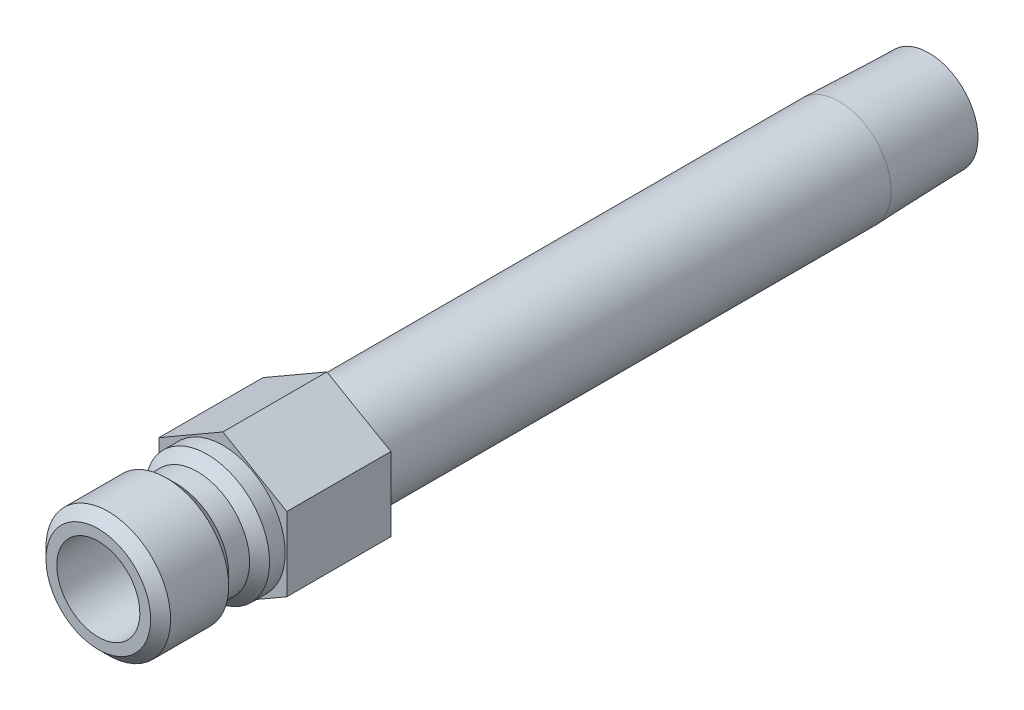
ISO-10303-21;
HEADER;
FILE_DESCRIPTION(('STEP AP214'),'2;1');
FILE_NAME('part.step','',(''),(''),'','','');
FILE_SCHEMA(('AUTOMOTIVE_DESIGN { 1 0 10303 214 1 1 1 1 }'));
ENDSEC;
DATA;
#1=APPLICATION_CONTEXT('core data for automotive mechanical design processes');
#2=APPLICATION_PROTOCOL_DEFINITION('international standard','automotive_design',2000,#1);
#3=PRODUCT_CONTEXT('',#1,'mechanical');
#4=PRODUCT('Part','Part','',(#3));
#5=PRODUCT_RELATED_PRODUCT_CATEGORY('part','',(#4));
#6=PRODUCT_DEFINITION_FORMATION('','',#4);
#7=PRODUCT_DEFINITION_CONTEXT('part definition',#1,'design');
#8=PRODUCT_DEFINITION('design','',#6,#7);
#9=PRODUCT_DEFINITION_SHAPE('','',#8);
#10=(LENGTH_UNIT() NAMED_UNIT(*) SI_UNIT(.MILLI.,.METRE.));
#11=(NAMED_UNIT(*) PLANE_ANGLE_UNIT() SI_UNIT($,.RADIAN.));
#12=(NAMED_UNIT(*) SI_UNIT($,.STERADIAN.) SOLID_ANGLE_UNIT());
#13=UNCERTAINTY_MEASURE_WITH_UNIT(LENGTH_MEASURE(1.E-05),#10,'distance_accuracy_value','');
#14=(GEOMETRIC_REPRESENTATION_CONTEXT(3) GLOBAL_UNCERTAINTY_ASSIGNED_CONTEXT((#13)) GLOBAL_UNIT_ASSIGNED_CONTEXT((#10,
#11,#12)) REPRESENTATION_CONTEXT('',''));
#15=CARTESIAN_POINT('',(0.,0.,0.));
#16=DIRECTION('',(0.,0.,1.));
#17=DIRECTION('',(1.,0.,0.));
#18=AXIS2_PLACEMENT_3D('',#15,#16,#17);
#19=CARTESIAN_POINT('',(0.,0.,0.));
#20=DIRECTION('',(0.,0.,-1.));
#21=DIRECTION('',(0.,1.,0.));
#22=AXIS2_PLACEMENT_3D('',#19,#20,#21);
#23=CYLINDRICAL_SURFACE('',#22,3.175);
#24=CARTESIAN_POINT('',(0.,0.,0.));
#25=DIRECTION('',(0.,0.,1.));
#26=DIRECTION('',(1.,0.,0.));
#27=AXIS2_PLACEMENT_3D('',#24,#25,#26);
#28=CIRCLE('',#27,3.175);
#29=CARTESIAN_POINT('',(3.175,0.,0.));
#30=VERTEX_POINT('',#29);
#31=EDGE_CURVE('E11',#30,#30,#28,.T.);
#32=ORIENTED_EDGE('',*,*,#31,.F.);
#33=EDGE_LOOP('',(#32));
#34=FACE_BOUND('',#33,.T.);
#35=CARTESIAN_POINT('',(0.,0.,9.525));
#36=DIRECTION('',(0.,0.,-1.));
#37=DIRECTION('',(0.,1.,0.));
#38=AXIS2_PLACEMENT_3D('',#35,#36,#37);
#39=CIRCLE('',#38,3.175);
#40=CARTESIAN_POINT('',(0.,3.175,9.525));
#41=VERTEX_POINT('',#40);
#42=EDGE_CURVE('E38',#41,#41,#39,.T.);
#43=ORIENTED_EDGE('',*,*,#42,.F.);
#44=EDGE_LOOP('',(#43));
#45=FACE_BOUND('',#44,.T.);
#46=ADVANCED_FACE('F35',(#34,#45),#23,.F.);
#47=CARTESIAN_POINT('',(0.,3.175,9.525));
#48=DIRECTION('',(0.,0.,1.));
#49=DIRECTION('',(0.,-1.,0.));
#50=AXIS2_PLACEMENT_3D('',#47,#48,#49);
#51=PLANE('',#50);
#52=ORIENTED_EDGE('',*,*,#42,.T.);
#53=EDGE_LOOP('',(#52));
#54=FACE_BOUND('',#53,.T.);
#55=CARTESIAN_POINT('',(0.,0.,9.525));
#56=DIRECTION('',(0.,0.,-1.));
#57=DIRECTION('',(0.,1.,0.));
#58=AXIS2_PLACEMENT_3D('',#55,#56,#57);
#59=CIRCLE('',#58,4.0005);
#60=CARTESIAN_POINT('',(0.,4.0005,9.525));
#61=VERTEX_POINT('',#60);
#62=EDGE_CURVE('E175',#61,#61,#59,.T.);
#63=ORIENTED_EDGE('',*,*,#62,.F.);
#64=EDGE_LOOP('',(#63));
#65=FACE_BOUND('',#64,.T.);
#66=ADVANCED_FACE('F182',(#54,#65),#51,.T.);
#67=CARTESIAN_POINT('',(0.,0.,8.763));
#68=DIRECTION('',(0.,0.,-1.));
#69=DIRECTION('',(0.,1.,0.));
#70=AXIS2_PLACEMENT_3D('',#67,#68,#69);
#71=CONICAL_SURFACE('',#70,4.7625,0.785398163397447);
#72=ORIENTED_EDGE('',*,*,#62,.T.);
#73=EDGE_LOOP('',(#72));
#74=FACE_BOUND('',#73,.T.);
#75=CARTESIAN_POINT('',(0.,0.,8.763));
#76=DIRECTION('',(0.,0.,-1.));
#77=DIRECTION('',(0.,1.,0.));
#78=AXIS2_PLACEMENT_3D('',#75,#76,#77);
#79=CIRCLE('',#78,4.7625);
#80=CARTESIAN_POINT('',(0.,4.7625,8.763));
#81=VERTEX_POINT('',#80);
#82=EDGE_CURVE('E173',#81,#81,#79,.T.);
#83=ORIENTED_EDGE('',*,*,#82,.F.);
#84=EDGE_LOOP('',(#83));
#85=FACE_BOUND('',#84,.T.);
#86=ADVANCED_FACE('F190',(#74,#85),#71,.T.);
#87=CARTESIAN_POINT('',(0.,0.,0.));
#88=DIRECTION('',(0.,0.,-1.));
#89=DIRECTION('',(0.,1.,0.));
#90=AXIS2_PLACEMENT_3D('',#87,#88,#89);
#91=CYLINDRICAL_SURFACE('',#90,4.7625);
#92=ORIENTED_EDGE('',*,*,#82,.T.);
#93=EDGE_LOOP('',(#92));
#94=FACE_BOUND('',#93,.T.);
#95=CARTESIAN_POINT('',(0.,0.,4.318));
#96=DIRECTION('',(0.,0.,-1.));
#97=DIRECTION('',(0.,1.,0.));
#98=AXIS2_PLACEMENT_3D('',#95,#96,#97);
#99=CIRCLE('',#98,4.7625);
#100=CARTESIAN_POINT('',(0.,4.7625,4.318));
#101=VERTEX_POINT('',#100);
#102=EDGE_CURVE('E170',#101,#101,#99,.T.);
#103=ORIENTED_EDGE('',*,*,#102,.F.);
#104=EDGE_LOOP('',(#103));
#105=FACE_BOUND('',#104,.T.);
#106=ADVANCED_FACE('F256',(#94,#105),#91,.T.);
#107=CARTESIAN_POINT('',(0.,0.,3.556));
#108=DIRECTION('',(0.,0.,1.));
#109=DIRECTION('',(0.,-1.,0.));
#110=AXIS2_PLACEMENT_3D('',#107,#108,#109);
#111=CONICAL_SURFACE('',#110,4.0005,0.785398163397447);
#112=ORIENTED_EDGE('',*,*,#102,.T.);
#113=EDGE_LOOP('',(#112));
#114=FACE_BOUND('',#113,.T.);
#115=CARTESIAN_POINT('',(0.,0.,3.556));
#116=DIRECTION('',(0.,0.,-1.));
#117=DIRECTION('',(0.,1.,0.));
#118=AXIS2_PLACEMENT_3D('',#115,#116,#117);
#119=CIRCLE('',#118,4.0005);
#120=CARTESIAN_POINT('',(0.,4.0005,3.556));
#121=VERTEX_POINT('',#120);
#122=EDGE_CURVE('E167',#121,#121,#119,.T.);
#123=ORIENTED_EDGE('',*,*,#122,.F.);
#124=EDGE_LOOP('',(#123));
#125=FACE_BOUND('',#124,.T.);
#126=ADVANCED_FACE('F252',(#114,#125),#111,.T.);
#127=CARTESIAN_POINT('',(0.,0.,0.));
#128=DIRECTION('',(0.,0.,-1.));
#129=DIRECTION('',(0.,1.,0.));
#130=AXIS2_PLACEMENT_3D('',#127,#128,#129);
#131=CYLINDRICAL_SURFACE('',#130,4.0005);
#132=ORIENTED_EDGE('',*,*,#122,.T.);
#133=EDGE_LOOP('',(#132));
#134=FACE_BOUND('',#133,.T.);
#135=CARTESIAN_POINT('',(0.,0.,1.9558));
#136=DIRECTION('',(0.,0.,-1.));
#137=DIRECTION('',(0.,1.,0.));
#138=AXIS2_PLACEMENT_3D('',#135,#136,#137);
#139=CIRCLE('',#138,4.0005);
#140=CARTESIAN_POINT('',(0.,4.0005,1.9558));
#141=VERTEX_POINT('',#140);
#142=EDGE_CURVE('E164',#141,#141,#139,.T.);
#143=ORIENTED_EDGE('',*,*,#142,.F.);
#144=EDGE_LOOP('',(#143));
#145=FACE_BOUND('',#144,.T.);
#146=ADVANCED_FACE('F248',(#134,#145),#131,.T.);
#147=CARTESIAN_POINT('',(0.,0.,1.1938));
#148=DIRECTION('',(0.,0.,-1.));
#149=DIRECTION('',(0.,1.,0.));
#150=AXIS2_PLACEMENT_3D('',#147,#148,#149);
#151=CONICAL_SURFACE('',#150,4.7625,0.785398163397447);
#152=ORIENTED_EDGE('',*,*,#142,.T.);
#153=EDGE_LOOP('',(#152));
#154=FACE_BOUND('',#153,.T.);
#155=CARTESIAN_POINT('',(0.,0.,1.1938));
#156=DIRECTION('',(0.,0.,-1.));
#157=DIRECTION('',(0.,1.,0.));
#158=AXIS2_PLACEMENT_3D('',#155,#156,#157);
#159=CIRCLE('',#158,4.7625);
#160=CARTESIAN_POINT('',(0.,4.7625,1.1938));
#161=VERTEX_POINT('',#160);
#162=EDGE_CURVE('E161',#161,#161,#159,.T.);
#163=ORIENTED_EDGE('',*,*,#162,.F.);
#164=EDGE_LOOP('',(#163));
#165=FACE_BOUND('',#164,.T.);
#166=ADVANCED_FACE('F244',(#154,#165),#151,.T.);
#167=CARTESIAN_POINT('',(0.,0.,0.));
#168=DIRECTION('',(0.,0.,-1.));
#169=DIRECTION('',(0.,1.,0.));
#170=AXIS2_PLACEMENT_3D('',#167,#168,#169);
#171=CYLINDRICAL_SURFACE('',#170,4.7625);
#172=ORIENTED_EDGE('',*,*,#162,.T.);
#173=EDGE_LOOP('',(#172));
#174=FACE_BOUND('',#173,.T.);
#175=CARTESIAN_POINT('',(0.,0.,0.));
#176=DIRECTION('',(0.,0.,-1.));
#177=DIRECTION('',(0.,1.,0.));
#178=AXIS2_PLACEMENT_3D('',#175,#176,#177);
#179=CIRCLE('',#178,4.7625);
#180=CARTESIAN_POINT('',(0.,4.7625,0.));
#181=VERTEX_POINT('',#180);
#182=EDGE_CURVE('E158',#181,#181,#179,.T.);
#183=ORIENTED_EDGE('',*,*,#182,.F.);
#184=EDGE_LOOP('',(#183));
#185=FACE_BOUND('',#184,.T.);
#186=ADVANCED_FACE('F197',(#174,#185),#171,.T.);
#187=CARTESIAN_POINT('',(-4.8895,2.82295414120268,0.));
#188=DIRECTION('',(0.,0.,1.));
#189=DIRECTION('',(1.,0.,0.));
#190=AXIS2_PLACEMENT_3D('',#187,#188,#189);
#191=PLANE('',#190);
#192=ORIENTED_EDGE('',*,*,#31,.T.);
#193=EDGE_LOOP('',(#192));
#194=FACE_BOUND('',#193,.T.);
#195=CARTESIAN_POINT('',(0.,0.,0.));
#196=DIRECTION('',(0.,0.,1.));
#197=DIRECTION('',(1.,0.,0.));
#198=AXIS2_PLACEMENT_3D('',#195,#196,#197);
#199=CIRCLE('',#198,2.38124999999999);
#200=CARTESIAN_POINT('',(2.38124999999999,0.,0.));
#201=VERTEX_POINT('',#200);
#202=EDGE_CURVE('E127',#201,#201,#199,.T.);
#203=ORIENTED_EDGE('',*,*,#202,.F.);
#204=EDGE_LOOP('',(#203));
#205=FACE_BOUND('',#204,.T.);
#206=ADVANCED_FACE('F193',(#194,#205),#191,.T.);
#207=CARTESIAN_POINT('',(0.,0.,-53.975));
#208=DIRECTION('',(0.,0.,1.));
#209=DIRECTION('',(0.,-1.,0.));
#210=AXIS2_PLACEMENT_3D('',#207,#208,#209);
#211=CONICAL_SURFACE('',#210,3.7544387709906,0.0312396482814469);
#212=CARTESIAN_POINT('',(0.,0.,-47.117));
#213=DIRECTION('',(0.,0.,-1.));
#214=DIRECTION('',(0.,1.,0.));
#215=AXIS2_PLACEMENT_3D('',#212,#213,#214);
#216=CIRCLE('',#215,3.96874999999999);
#217=CARTESIAN_POINT('',(0.,3.96875,-47.117));
#218=VERTEX_POINT('',#217);
#219=EDGE_CURVE('E155',#218,#218,#216,.T.);
#220=ORIENTED_EDGE('',*,*,#219,.T.);
#221=EDGE_LOOP('',(#220));
#222=FACE_BOUND('',#221,.T.);
#223=CARTESIAN_POINT('',(0.,0.,-53.975));
#224=DIRECTION('',(0.,0.,-1.));
#225=DIRECTION('',(0.,1.,0.));
#226=AXIS2_PLACEMENT_3D('',#223,#224,#225);
#227=CIRCLE('',#226,3.7544387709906);
#228=CARTESIAN_POINT('',(0.,3.7544387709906,-53.975));
#229=VERTEX_POINT('',#228);
#230=EDGE_CURVE('E152',#229,#229,#227,.T.);
#231=ORIENTED_EDGE('',*,*,#230,.F.);
#232=EDGE_LOOP('',(#231));
#233=FACE_BOUND('',#232,.T.);
#234=ADVANCED_FACE('F196',(#222,#233),#211,.T.);
#235=CARTESIAN_POINT('',(0.,0.,0.));
#236=DIRECTION('',(0.,0.,-1.));
#237=DIRECTION('',(0.,1.,0.));
#238=AXIS2_PLACEMENT_3D('',#235,#236,#237);
#239=CYLINDRICAL_SURFACE('',#238,3.96875);
#240=ORIENTED_EDGE('',*,*,#219,.F.);
#241=EDGE_LOOP('',(#240));
#242=FACE_BOUND('',#241,.T.);
#243=CARTESIAN_POINT('',(0.,0.,-7.9502));
#244=DIRECTION('',(0.,0.,1.));
#245=DIRECTION('',(1.,0.,0.));
#246=AXIS2_PLACEMENT_3D('',#243,#244,#245);
#247=CIRCLE('',#246,3.96875);
#248=CARTESIAN_POINT('',(3.96875,0.,-7.9502));
#249=VERTEX_POINT('',#248);
#250=EDGE_CURVE('E141',#249,#249,#247,.F.);
#251=ORIENTED_EDGE('',*,*,#250,.T.);
#252=EDGE_LOOP('',(#251));
#253=FACE_BOUND('',#252,.T.);
#254=ADVANCED_FACE('F234',(#242,#253),#239,.T.);
#255=CARTESIAN_POINT('',(0.,3.7544387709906,-53.975));
#256=DIRECTION('',(0.,0.,-1.));
#257=DIRECTION('',(0.,1.,0.));
#258=AXIS2_PLACEMENT_3D('',#255,#256,#257);
#259=PLANE('',#258);
#260=ORIENTED_EDGE('',*,*,#230,.T.);
#261=EDGE_LOOP('',(#260));
#262=FACE_BOUND('',#261,.T.);
#263=CARTESIAN_POINT('',(0.,0.,-53.975));
#264=DIRECTION('',(0.,0.,-1.));
#265=DIRECTION('',(0.,1.,0.));
#266=AXIS2_PLACEMENT_3D('',#263,#264,#265);
#267=CIRCLE('',#266,2.38124999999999);
#268=CARTESIAN_POINT('',(0.,2.38125,-53.975));
#269=VERTEX_POINT('',#268);
#270=EDGE_CURVE('E148',#269,#269,#267,.T.);
#271=ORIENTED_EDGE('',*,*,#270,.F.);
#272=EDGE_LOOP('',(#271));
#273=FACE_BOUND('',#272,.T.);
#274=ADVANCED_FACE('F231',(#262,#273),#259,.T.);
#275=CARTESIAN_POINT('',(0.,0.,0.));
#276=DIRECTION('',(0.,0.,-1.));
#277=DIRECTION('',(0.,1.,0.));
#278=AXIS2_PLACEMENT_3D('',#275,#276,#277);
#279=CYLINDRICAL_SURFACE('',#278,2.38125);
#280=ORIENTED_EDGE('',*,*,#202,.T.);
#281=EDGE_LOOP('',(#280));
#282=FACE_BOUND('',#281,.T.);
#283=ORIENTED_EDGE('',*,*,#270,.T.);
#284=EDGE_LOOP('',(#283));
#285=FACE_BOUND('',#284,.T.);
#286=ADVANCED_FACE('F217',(#282,#285),#279,.F.);
#287=CARTESIAN_POINT('',(0.,5.64590828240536,-7.9502));
#288=DIRECTION('',(-0.5,0.866025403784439,0.));
#289=DIRECTION('',(-0.866025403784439,-0.5,0.));
#290=AXIS2_PLACEMENT_3D('',#287,#288,#289);
#291=PLANE('',#290);
#292=DIRECTION('',(-0.866025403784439,-0.5,0.));
#293=VECTOR('',#292,1.);
#294=CARTESIAN_POINT('',(0.,5.64590828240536,0.));
#295=LINE('',#294,#293);
#296=CARTESIAN_POINT('',(0.,5.64590828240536,0.));
#297=VERTEX_POINT('',#296);
#298=CARTESIAN_POINT('',(-4.8895,2.82295414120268,0.));
#299=VERTEX_POINT('',#298);
#300=EDGE_CURVE('E123',#297,#299,#295,.T.);
#301=ORIENTED_EDGE('',*,*,#300,.F.);
#302=DIRECTION('',(0.,0.,1.));
#303=VECTOR('',#302,1.);
#304=CARTESIAN_POINT('',(0.,5.64590828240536,-7.9502));
#305=LINE('',#304,#303);
#306=CARTESIAN_POINT('',(0.,5.64590828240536,-7.9502));
#307=VERTEX_POINT('',#306);
#308=EDGE_CURVE('E52',#307,#297,#305,.T.);
#309=ORIENTED_EDGE('',*,*,#308,.F.);
#310=DIRECTION('',(-0.866025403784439,-0.5,0.));
#311=VECTOR('',#310,1.);
#312=CARTESIAN_POINT('',(0.,5.64590828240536,-7.9502));
#313=LINE('',#312,#311);
#314=CARTESIAN_POINT('',(-4.8895,2.82295414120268,-7.9502));
#315=VERTEX_POINT('',#314);
#316=EDGE_CURVE('E139',#307,#315,#313,.T.);
#317=ORIENTED_EDGE('',*,*,#316,.T.);
#318=DIRECTION('',(0.,0.,1.));
#319=VECTOR('',#318,1.);
#320=CARTESIAN_POINT('',(-4.8895,2.82295414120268,-7.9502));
#321=LINE('',#320,#319);
#322=EDGE_CURVE('E87',#315,#299,#321,.T.);
#323=ORIENTED_EDGE('',*,*,#322,.T.);
#324=EDGE_LOOP('',(#301,#309,#317,#323));
#325=FACE_BOUND('',#324,.T.);
#326=ADVANCED_FACE('F207',(#325),#291,.T.);
#327=CARTESIAN_POINT('',(4.8895,2.82295414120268,-7.9502));
#328=DIRECTION('',(0.5,0.866025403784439,0.));
#329=DIRECTION('',(-0.866025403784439,0.5,0.));
#330=AXIS2_PLACEMENT_3D('',#327,#328,#329);
#331=PLANE('',#330);
#332=DIRECTION('',(-0.866025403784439,0.5,0.));
#333=VECTOR('',#332,1.);
#334=CARTESIAN_POINT('',(4.8895,2.82295414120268,0.));
#335=LINE('',#334,#333);
#336=CARTESIAN_POINT('',(4.8895,2.82295414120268,0.));
#337=VERTEX_POINT('',#336);
#338=EDGE_CURVE('E136',#337,#297,#335,.T.);
#339=ORIENTED_EDGE('',*,*,#338,.F.);
#340=DIRECTION('',(0.,0.,1.));
#341=VECTOR('',#340,1.);
#342=CARTESIAN_POINT('',(4.8895,2.82295414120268,-7.9502));
#343=LINE('',#342,#341);
#344=CARTESIAN_POINT('',(4.8895,2.82295414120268,-7.9502));
#345=VERTEX_POINT('',#344);
#346=EDGE_CURVE('E75',#345,#337,#343,.T.);
#347=ORIENTED_EDGE('',*,*,#346,.F.);
#348=DIRECTION('',(-0.866025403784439,0.5,0.));
#349=VECTOR('',#348,1.);
#350=CARTESIAN_POINT('',(4.8895,2.82295414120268,-7.9502));
#351=LINE('',#350,#349);
#352=EDGE_CURVE('E113',#345,#307,#351,.T.);
#353=ORIENTED_EDGE('',*,*,#352,.T.);
#354=ORIENTED_EDGE('',*,*,#308,.T.);
#355=EDGE_LOOP('',(#339,#347,#353,#354));
#356=FACE_BOUND('',#355,.T.);
#357=ADVANCED_FACE('F209',(#356),#331,.T.);
#358=CARTESIAN_POINT('',(4.8895,-2.82295414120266,-7.9502));
#359=DIRECTION('',(1.,0.,0.));
#360=DIRECTION('',(0.,0.,-1.));
#361=AXIS2_PLACEMENT_3D('',#358,#359,#360);
#362=PLANE('',#361);
#363=DIRECTION('',(0.,1.,0.));
#364=VECTOR('',#363,1.);
#365=CARTESIAN_POINT('',(4.8895,-2.82295414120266,0.));
#366=LINE('',#365,#364);
#367=CARTESIAN_POINT('',(4.8895,-2.82295414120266,0.));
#368=VERTEX_POINT('',#367);
#369=EDGE_CURVE('E100',#368,#337,#366,.T.);
#370=ORIENTED_EDGE('',*,*,#369,.F.);
#371=DIRECTION('',(0.,0.,1.));
#372=VECTOR('',#371,1.);
#373=CARTESIAN_POINT('',(4.8895,-2.82295414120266,-7.9502));
#374=LINE('',#373,#372);
#375=CARTESIAN_POINT('',(4.8895,-2.82295414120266,-7.9502));
#376=VERTEX_POINT('',#375);
#377=EDGE_CURVE('E95',#376,#368,#374,.T.);
#378=ORIENTED_EDGE('',*,*,#377,.F.);
#379=DIRECTION('',(0.,1.,0.));
#380=VECTOR('',#379,1.);
#381=CARTESIAN_POINT('',(4.8895,-2.82295414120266,-7.9502));
#382=LINE('',#381,#380);
#383=EDGE_CURVE('E98',#376,#345,#382,.T.);
#384=ORIENTED_EDGE('',*,*,#383,.T.);
#385=ORIENTED_EDGE('',*,*,#346,.T.);
#386=EDGE_LOOP('',(#370,#378,#384,#385));
#387=FACE_BOUND('',#386,.T.);
#388=ADVANCED_FACE('F97',(#387),#362,.T.);
#389=CARTESIAN_POINT('',(0.,-5.64590828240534,-7.9502));
#390=DIRECTION('',(0.5,-0.866025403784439,0.));
#391=DIRECTION('',(0.866025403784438,0.5,0.));
#392=AXIS2_PLACEMENT_3D('',#389,#390,#391);
#393=PLANE('',#392);
#394=DIRECTION('',(0.866025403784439,0.5,0.));
#395=VECTOR('',#394,1.);
#396=CARTESIAN_POINT('',(0.,-5.64590828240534,0.));
#397=LINE('',#396,#395);
#398=CARTESIAN_POINT('',(0.,-5.64590828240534,0.));
#399=VERTEX_POINT('',#398);
#400=EDGE_CURVE('E133',#399,#368,#397,.T.);
#401=ORIENTED_EDGE('',*,*,#400,.F.);
#402=DIRECTION('',(0.,0.,1.));
#403=VECTOR('',#402,1.);
#404=CARTESIAN_POINT('',(0.,-5.64590828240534,-7.9502));
#405=LINE('',#404,#403);
#406=CARTESIAN_POINT('',(0.,-5.64590828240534,-7.9502));
#407=VERTEX_POINT('',#406);
#408=EDGE_CURVE('E105',#407,#399,#405,.T.);
#409=ORIENTED_EDGE('',*,*,#408,.F.);
#410=DIRECTION('',(0.866025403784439,0.5,0.));
#411=VECTOR('',#410,1.);
#412=CARTESIAN_POINT('',(0.,-5.64590828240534,-7.9502));
#413=LINE('',#412,#411);
#414=EDGE_CURVE('E111',#407,#376,#413,.T.);
#415=ORIENTED_EDGE('',*,*,#414,.T.);
#416=ORIENTED_EDGE('',*,*,#377,.T.);
#417=EDGE_LOOP('',(#401,#409,#415,#416));
#418=FACE_BOUND('',#417,.T.);
#419=ADVANCED_FACE('F115',(#418),#393,.T.);
#420=CARTESIAN_POINT('',(-4.8895,-2.82295414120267,-7.9502));
#421=DIRECTION('',(-0.5,-0.866025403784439,0.));
#422=DIRECTION('',(0.866025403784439,-0.5,0.));
#423=AXIS2_PLACEMENT_3D('',#420,#421,#422);
#424=PLANE('',#423);
#425=DIRECTION('',(0.866025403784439,-0.5,0.));
#426=VECTOR('',#425,1.);
#427=CARTESIAN_POINT('',(-4.8895,-2.82295414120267,0.));
#428=LINE('',#427,#426);
#429=CARTESIAN_POINT('',(-4.8895,-2.82295414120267,0.));
#430=VERTEX_POINT('',#429);
#431=EDGE_CURVE('E130',#430,#399,#428,.T.);
#432=ORIENTED_EDGE('',*,*,#431,.F.);
#433=DIRECTION('',(0.,0.,1.));
#434=VECTOR('',#433,1.);
#435=CARTESIAN_POINT('',(-4.8895,-2.82295414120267,-7.9502));
#436=LINE('',#435,#434);
#437=CARTESIAN_POINT('',(-4.8895,-2.82295414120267,-7.9502));
#438=VERTEX_POINT('',#437);
#439=EDGE_CURVE('E144',#438,#430,#436,.T.);
#440=ORIENTED_EDGE('',*,*,#439,.F.);
#441=DIRECTION('',(0.866025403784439,-0.5,0.));
#442=VECTOR('',#441,1.);
#443=CARTESIAN_POINT('',(-4.8895,-2.82295414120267,-7.9502));
#444=LINE('',#443,#442);
#445=EDGE_CURVE('E116',#438,#407,#444,.T.);
#446=ORIENTED_EDGE('',*,*,#445,.T.);
#447=ORIENTED_EDGE('',*,*,#408,.T.);
#448=EDGE_LOOP('',(#432,#440,#446,#447));
#449=FACE_BOUND('',#448,.T.);
#450=ADVANCED_FACE('F223',(#449),#424,.T.);
#451=CARTESIAN_POINT('',(-4.8895,2.82295414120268,-7.9502));
#452=DIRECTION('',(-1.,0.,0.));
#453=DIRECTION('',(0.,0.,1.));
#454=AXIS2_PLACEMENT_3D('',#451,#452,#453);
#455=PLANE('',#454);
#456=DIRECTION('',(0.,-1.,0.));
#457=VECTOR('',#456,1.);
#458=CARTESIAN_POINT('',(-4.8895,2.82295414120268,0.));
#459=LINE('',#458,#457);
#460=EDGE_CURVE('E126',#299,#430,#459,.T.);
#461=ORIENTED_EDGE('',*,*,#460,.F.);
#462=ORIENTED_EDGE('',*,*,#322,.F.);
#463=DIRECTION('',(0.,-1.,0.));
#464=VECTOR('',#463,1.);
#465=CARTESIAN_POINT('',(-4.8895,2.82295414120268,-7.9502));
#466=LINE('',#465,#464);
#467=EDGE_CURVE('E118',#315,#438,#466,.T.);
#468=ORIENTED_EDGE('',*,*,#467,.T.);
#469=ORIENTED_EDGE('',*,*,#439,.T.);
#470=EDGE_LOOP('',(#461,#462,#468,#469));
#471=FACE_BOUND('',#470,.T.);
#472=ADVANCED_FACE('F205',(#471),#455,.T.);
#473=CARTESIAN_POINT('',(-4.8895,2.82295414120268,-7.9502));
#474=DIRECTION('',(0.,0.,1.));
#475=DIRECTION('',(1.,0.,0.));
#476=AXIS2_PLACEMENT_3D('',#473,#474,#475);
#477=PLANE('',#476);
#478=ORIENTED_EDGE('',*,*,#250,.F.);
#479=EDGE_LOOP('',(#478));
#480=FACE_BOUND('',#479,.T.);
#481=ORIENTED_EDGE('',*,*,#316,.F.);
#482=ORIENTED_EDGE('',*,*,#352,.F.);
#483=ORIENTED_EDGE('',*,*,#383,.F.);
#484=ORIENTED_EDGE('',*,*,#414,.F.);
#485=ORIENTED_EDGE('',*,*,#445,.F.);
#486=ORIENTED_EDGE('',*,*,#467,.F.);
#487=EDGE_LOOP('',(#481,#482,#483,#484,#485,#486));
#488=FACE_BOUND('',#487,.T.);
#489=ADVANCED_FACE('F109',(#480,#488),#477,.F.);
#490=ORIENTED_EDGE('',*,*,#182,.T.);
#491=EDGE_LOOP('',(#490));
#492=FACE_BOUND('',#491,.T.);
#493=ORIENTED_EDGE('',*,*,#300,.T.);
#494=ORIENTED_EDGE('',*,*,#460,.T.);
#495=ORIENTED_EDGE('',*,*,#431,.T.);
#496=ORIENTED_EDGE('',*,*,#400,.T.);
#497=ORIENTED_EDGE('',*,*,#369,.T.);
#498=ORIENTED_EDGE('',*,*,#338,.T.);
#499=EDGE_LOOP('',(#493,#494,#495,#496,#497,#498));
#500=FACE_BOUND('',#499,.T.);
#501=ADVANCED_FACE('F199',(#492,#500),#191,.T.);
#502=CLOSED_SHELL('',(#46,#66,#86,#106,#126,#146,#166,#186,#206,#234,#254,#274,#286,#326,#357,
#388,#419,#450,#472,#489,#501));
#503=MANIFOLD_SOLID_BREP('B2',#502);
#504=ADVANCED_BREP_SHAPE_REPRESENTATION('',(#18,#503),#14);
#505=SHAPE_DEFINITION_REPRESENTATION(#9,#504);
ENDSEC;
END-ISO-10303-21;
